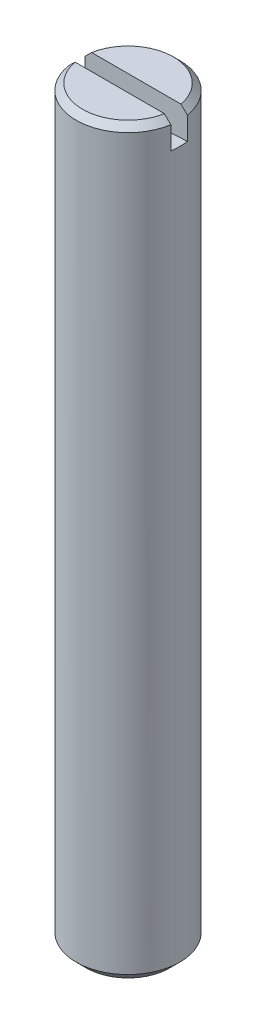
ISO-10303-21;
HEADER;
FILE_DESCRIPTION(('STEP AP214'),'2;1');
FILE_NAME('part.step','',(''),(''),'','','');
FILE_SCHEMA(('AUTOMOTIVE_DESIGN { 1 0 10303 214 1 1 1 1 }'));
ENDSEC;
DATA;
#1=APPLICATION_CONTEXT('core data for automotive mechanical design processes');
#2=APPLICATION_PROTOCOL_DEFINITION('international standard','automotive_design',2000,#1);
#3=PRODUCT_CONTEXT('',#1,'mechanical');
#4=PRODUCT('Part','Part','',(#3));
#5=PRODUCT_RELATED_PRODUCT_CATEGORY('part','',(#4));
#6=PRODUCT_DEFINITION_FORMATION('','',#4);
#7=PRODUCT_DEFINITION_CONTEXT('part definition',#1,'design');
#8=PRODUCT_DEFINITION('design','',#6,#7);
#9=PRODUCT_DEFINITION_SHAPE('','',#8);
#10=(LENGTH_UNIT() NAMED_UNIT(*) SI_UNIT(.MILLI.,.METRE.));
#11=(NAMED_UNIT(*) PLANE_ANGLE_UNIT() SI_UNIT($,.RADIAN.));
#12=(NAMED_UNIT(*) SI_UNIT($,.STERADIAN.) SOLID_ANGLE_UNIT());
#13=UNCERTAINTY_MEASURE_WITH_UNIT(LENGTH_MEASURE(1.E-05),#10,'distance_accuracy_value','');
#14=(GEOMETRIC_REPRESENTATION_CONTEXT(3) GLOBAL_UNCERTAINTY_ASSIGNED_CONTEXT((#13)) GLOBAL_UNIT_ASSIGNED_CONTEXT((#10,
#11,#12)) REPRESENTATION_CONTEXT('',''));
#15=CARTESIAN_POINT('',(0.,0.,0.));
#16=DIRECTION('',(0.,0.,1.));
#17=DIRECTION('',(1.,0.,0.));
#18=AXIS2_PLACEMENT_3D('',#15,#16,#17);
#19=CARTESIAN_POINT('',(0.,66.,0.4));
#20=DIRECTION('',(0.,0.,-1.));
#21=DIRECTION('',(-1.,0.,0.));
#22=AXIS2_PLACEMENT_3D('',#19,#20,#21);
#23=CYLINDRICAL_SURFACE('',#22,31.5);
#24=CARTESIAN_POINT('',(2.46779253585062,34.596815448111,-0.4));
#25=CARTESIAN_POINT('',(2.47854531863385,34.5976618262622,-0.333698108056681));
#26=CARTESIAN_POINT('',(2.48661458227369,34.598300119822,-0.266959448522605));
#27=CARTESIAN_POINT('',(2.49732458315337,34.5991493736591,-0.133478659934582));
#28=CARTESIAN_POINT('',(2.5,34.5993630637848,-0.066739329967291));
#29=CARTESIAN_POINT('',(2.5,34.5993630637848,0.066739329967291));
#30=CARTESIAN_POINT('',(2.49732458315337,34.5991493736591,0.133478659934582));
#31=CARTESIAN_POINT('',(2.48661458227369,34.598300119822,0.266959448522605));
#32=CARTESIAN_POINT('',(2.47854531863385,34.5976618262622,0.333698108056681));
#33=CARTESIAN_POINT('',(2.46779253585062,34.596815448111,0.4));
#34=B_SPLINE_CURVE_WITH_KNOTS('',3,(#24,#25,#26,#27,#28,#29,#30,#31,#32,#33),.UNSPECIFIED.,.F.,
.F.,(4,2,2,2,4),(0.,0.201464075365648,0.401628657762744,0.601793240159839,0.803257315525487),.UNSPECIFIED.);
#35=CARTESIAN_POINT('',(2.46779253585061,34.596815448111,-0.4));
#36=VERTEX_POINT('',#35);
#37=CARTESIAN_POINT('',(2.46779253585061,34.596815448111,0.4));
#38=VERTEX_POINT('',#37);
#39=EDGE_CURVE('E81',#36,#38,#34,.T.);
#40=ORIENTED_EDGE('',*,*,#39,.F.);
#41=CARTESIAN_POINT('',(0.,66.,-0.4));
#42=DIRECTION('',(0.,0.,-1.));
#43=DIRECTION('',(-1.,0.,0.));
#44=AXIS2_PLACEMENT_3D('',#41,#42,#43);
#45=CIRCLE('',#44,31.5);
#46=CARTESIAN_POINT('',(-2.46779253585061,34.596815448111,-0.4));
#47=VERTEX_POINT('',#46);
#48=EDGE_CURVE('E87',#47,#36,#45,.F.);
#49=ORIENTED_EDGE('',*,*,#48,.F.);
#50=CARTESIAN_POINT('',(-2.46779253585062,34.596815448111,0.4));
#51=CARTESIAN_POINT('',(-2.47854531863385,34.5976618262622,0.333698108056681));
#52=CARTESIAN_POINT('',(-2.48661458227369,34.598300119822,0.266959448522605));
#53=CARTESIAN_POINT('',(-2.49732458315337,34.5991493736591,0.133478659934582));
#54=CARTESIAN_POINT('',(-2.5,34.5993630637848,0.066739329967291));
#55=CARTESIAN_POINT('',(-2.5,34.5993630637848,-0.066739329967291));
#56=CARTESIAN_POINT('',(-2.49732458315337,34.5991493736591,-0.133478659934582));
#57=CARTESIAN_POINT('',(-2.48661458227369,34.598300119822,-0.266959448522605));
#58=CARTESIAN_POINT('',(-2.47854531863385,34.5976618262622,-0.333698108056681));
#59=CARTESIAN_POINT('',(-2.46779253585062,34.596815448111,-0.4));
#60=B_SPLINE_CURVE_WITH_KNOTS('',3,(#50,#51,#52,#53,#54,#55,#56,#57,#58,#59),.UNSPECIFIED.,.F.,
.F.,(4,2,2,2,4),(0.,0.201464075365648,0.401628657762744,0.601793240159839,0.803257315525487),.UNSPECIFIED.);
#61=CARTESIAN_POINT('',(-2.46779253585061,34.596815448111,0.4));
#62=VERTEX_POINT('',#61);
#63=EDGE_CURVE('E18',#62,#47,#60,.T.);
#64=ORIENTED_EDGE('',*,*,#63,.F.);
#65=CARTESIAN_POINT('',(0.,66.,0.4));
#66=DIRECTION('',(0.,0.,-1.));
#67=DIRECTION('',(-1.,0.,0.));
#68=AXIS2_PLACEMENT_3D('',#65,#66,#67);
#69=CIRCLE('',#68,31.5);
#70=EDGE_CURVE('E80',#62,#38,#69,.F.);
#71=ORIENTED_EDGE('',*,*,#70,.T.);
#72=EDGE_LOOP('',(#40,#49,#64,#71));
#73=FACE_BOUND('',#72,.T.);
#74=ADVANCED_FACE('F14',(#73),#23,.F.);
#75=CARTESIAN_POINT('',(0.,66.,0.4));
#76=DIRECTION('',(0.,0.,1.));
#77=DIRECTION('',(1.,0.,0.));
#78=AXIS2_PLACEMENT_3D('',#75,#76,#77);
#79=PLANE('',#78);
#80=DIRECTION('',(1.,0.,0.));
#81=VECTOR('',#80,1.);
#82=CARTESIAN_POINT('',(0.,36.,0.4));
#83=LINE('',#82,#81);
#84=CARTESIAN_POINT('',(-2.15672025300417,35.9999999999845,0.4));
#85=VERTEX_POINT('',#84);
#86=CARTESIAN_POINT('',(2.15672025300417,35.9999999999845,0.4));
#87=VERTEX_POINT('',#86);
#88=EDGE_CURVE('E156',#85,#87,#83,.T.);
#89=ORIENTED_EDGE('',*,*,#88,.T.);
#90=CARTESIAN_POINT('',(2.46779253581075,35.6934999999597,0.4));
#91=CARTESIAN_POINT('',(2.41599728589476,35.7446342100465,0.4));
#92=CARTESIAN_POINT('',(2.36417697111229,35.795742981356,0.4));
#93=CARTESIAN_POINT('',(2.26048621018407,35.8979096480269,0.4));
#94=CARTESIAN_POINT('',(2.20861576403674,35.9489675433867,0.4));
#95=CARTESIAN_POINT('',(2.15672025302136,35.9999999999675,0.4));
#96=B_SPLINE_CURVE_WITH_KNOTS('',3,(#90,#91,#92,#93,#94,#95),.UNSPECIFIED.,.F.,.F.,(4,2,4),(0.,
0.218350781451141,0.436701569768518),.UNSPECIFIED.);
#97=CARTESIAN_POINT('',(2.46779253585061,35.6934999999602,0.4));
#98=VERTEX_POINT('',#97);
#99=EDGE_CURVE('E94',#98,#87,#96,.T.);
#100=ORIENTED_EDGE('',*,*,#99,.F.);
#101=DIRECTION('',(0.,1.,0.));
#102=VECTOR('',#101,1.);
#103=CARTESIAN_POINT('',(2.46779253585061,66.,0.4));
#104=LINE('',#103,#102);
#105=EDGE_CURVE('E92',#38,#98,#104,.T.);
#106=ORIENTED_EDGE('',*,*,#105,.F.);
#107=ORIENTED_EDGE('',*,*,#70,.F.);
#108=DIRECTION('',(0.,1.,0.));
#109=VECTOR('',#108,1.);
#110=CARTESIAN_POINT('',(-2.46779253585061,66.,0.4));
#111=LINE('',#110,#109);
#112=CARTESIAN_POINT('',(-2.46779253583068,35.6934999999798,0.4));
#113=VERTEX_POINT('',#112);
#114=EDGE_CURVE('E72',#113,#62,#111,.F.);
#115=ORIENTED_EDGE('',*,*,#114,.F.);
#116=CARTESIAN_POINT('',(-2.15672025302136,35.9999999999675,0.4));
#117=CARTESIAN_POINT('',(-2.20861576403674,35.9489675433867,0.4));
#118=CARTESIAN_POINT('',(-2.26048621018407,35.8979096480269,0.4));
#119=CARTESIAN_POINT('',(-2.36417697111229,35.795742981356,0.4));
#120=CARTESIAN_POINT('',(-2.41599728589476,35.7446342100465,0.4));
#121=CARTESIAN_POINT('',(-2.46779253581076,35.6934999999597,0.4));
#122=B_SPLINE_CURVE_WITH_KNOTS('',3,(#116,#117,#118,#119,#120,#121),.UNSPECIFIED.,.F.,.F.,(4,2,
4),(0.,0.218350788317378,0.436701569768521),.UNSPECIFIED.);
#123=EDGE_CURVE('E144',#85,#113,#122,.T.);
#124=ORIENTED_EDGE('',*,*,#123,.F.);
#125=EDGE_LOOP('',(#89,#100,#106,#107,#115,#124));
#126=FACE_BOUND('',#125,.T.);
#127=ADVANCED_FACE('F90',(#126),#79,.F.);
#128=CARTESIAN_POINT('',(0.,66.,-0.4));
#129=DIRECTION('',(0.,0.,1.));
#130=DIRECTION('',(1.,0.,0.));
#131=AXIS2_PLACEMENT_3D('',#128,#129,#130);
#132=PLANE('',#131);
#133=DIRECTION('',(1.,0.,0.));
#134=VECTOR('',#133,1.);
#135=CARTESIAN_POINT('',(0.,36.,-0.4));
#136=LINE('',#135,#134);
#137=CARTESIAN_POINT('',(2.15672025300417,35.9999999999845,-0.4));
#138=VERTEX_POINT('',#137);
#139=CARTESIAN_POINT('',(-2.15672025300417,35.9999999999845,-0.4));
#140=VERTEX_POINT('',#139);
#141=EDGE_CURVE('E158',#138,#140,#136,.F.);
#142=ORIENTED_EDGE('',*,*,#141,.T.);
#143=CARTESIAN_POINT('',(-2.15672025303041,35.9999999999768,-0.400000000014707));
#144=CARTESIAN_POINT('',(-2.20861576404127,35.9489675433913,-0.400000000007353));
#145=CARTESIAN_POINT('',(-2.26048621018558,35.8979096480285,-0.400000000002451));
#146=CARTESIAN_POINT('',(-2.36417697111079,35.7957429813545,-0.399999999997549));
#147=CARTESIAN_POINT('',(-2.41599728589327,35.7446342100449,-0.399999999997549));
#148=CARTESIAN_POINT('',(-2.46779253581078,35.6934999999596,-0.4));
#149=B_SPLINE_CURVE_WITH_KNOTS('',3,(#143,#144,#145,#146,#147,#148),.UNSPECIFIED.,.F.,.F.,(4,2,
4),(0.,0.218350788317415,0.436701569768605),.UNSPECIFIED.);
#150=CARTESIAN_POINT('',(-2.46779253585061,35.6934999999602,-0.4));
#151=VERTEX_POINT('',#150);
#152=EDGE_CURVE('E38',#140,#151,#149,.T.);
#153=ORIENTED_EDGE('',*,*,#152,.T.);
#154=DIRECTION('',(0.,1.,0.));
#155=VECTOR('',#154,1.);
#156=CARTESIAN_POINT('',(-2.46779253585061,66.,-0.4));
#157=LINE('',#156,#155);
#158=EDGE_CURVE('E149',#151,#47,#157,.F.);
#159=ORIENTED_EDGE('',*,*,#158,.T.);
#160=ORIENTED_EDGE('',*,*,#48,.T.);
#161=DIRECTION('',(0.,1.,0.));
#162=VECTOR('',#161,1.);
#163=CARTESIAN_POINT('',(2.46779253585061,66.,-0.4));
#164=LINE('',#163,#162);
#165=CARTESIAN_POINT('',(2.46779253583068,35.6934999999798,-0.4));
#166=VERTEX_POINT('',#165);
#167=EDGE_CURVE('E132',#36,#166,#164,.T.);
#168=ORIENTED_EDGE('',*,*,#167,.T.);
#169=CARTESIAN_POINT('',(2.46779253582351,35.6934999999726,-0.400000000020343));
#170=CARTESIAN_POINT('',(2.41599728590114,35.7446342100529,-0.400000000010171));
#171=CARTESIAN_POINT('',(2.36417697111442,35.7957429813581,-0.400000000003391));
#172=CARTESIAN_POINT('',(2.26048621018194,35.8979096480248,-0.39999999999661));
#173=CARTESIAN_POINT('',(2.20861576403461,35.9489675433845,-0.39999999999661));
#174=CARTESIAN_POINT('',(2.15672025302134,35.9999999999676,-0.4));
#175=B_SPLINE_CURVE_WITH_KNOTS('',3,(#169,#170,#171,#172,#173,#174),.UNSPECIFIED.,.F.,.F.,(4,2,
4),(0.,0.218350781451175,0.436701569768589),.UNSPECIFIED.);
#176=EDGE_CURVE('E126',#166,#138,#175,.T.);
#177=ORIENTED_EDGE('',*,*,#176,.T.);
#178=EDGE_LOOP('',(#142,#153,#159,#160,#168,#177));
#179=FACE_BOUND('',#178,.T.);
#180=ADVANCED_FACE('F133',(#179),#132,.T.);
#181=CARTESIAN_POINT('',(2.0095,0.,0.));
#182=DIRECTION('',(0.,1.,0.));
#183=DIRECTION('',(0.,0.,1.));
#184=AXIS2_PLACEMENT_3D('',#181,#182,#183);
#185=PLANE('',#184);
#186=CARTESIAN_POINT('',(0.,-5.6843418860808E-11,0.));
#187=DIRECTION('',(0.,1.,0.));
#188=DIRECTION('',(0.,0.,1.));
#189=AXIS2_PLACEMENT_3D('',#186,#187,#188);
#190=CIRCLE('',#189,2.00949999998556);
#191=CARTESIAN_POINT('',(0.,-5.6843418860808E-11,2.00949999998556));
#192=VERTEX_POINT('',#191);
#193=EDGE_CURVE('E162',#192,#192,#190,.T.);
#194=ORIENTED_EDGE('',*,*,#193,.F.);
#195=EDGE_LOOP('',(#194));
#196=FACE_BOUND('',#195,.T.);
#197=ADVANCED_FACE('F137',(#196),#185,.F.);
#198=CARTESIAN_POINT('',(0.,36.,0.));
#199=DIRECTION('',(0.,-1.,0.));
#200=DIRECTION('',(0.,0.,-1.));
#201=AXIS2_PLACEMENT_3D('',#198,#199,#200);
#202=PLANE('',#201);
#203=ORIENTED_EDGE('',*,*,#88,.F.);
#204=CARTESIAN_POINT('',(0.,36.0000000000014,0.));
#205=DIRECTION('',(0.,-1.,0.));
#206=DIRECTION('',(0.,0.,-1.));
#207=AXIS2_PLACEMENT_3D('',#204,#205,#206);
#208=CIRCLE('',#207,2.19349999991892);
#209=EDGE_CURVE('E154',#87,#85,#208,.T.);
#210=ORIENTED_EDGE('',*,*,#209,.F.);
#211=EDGE_LOOP('',(#203,#210));
#212=FACE_BOUND('',#211,.T.);
#213=ADVANCED_FACE('F160',(#212),#202,.F.);
#214=CARTESIAN_POINT('',(0.,36.,0.));
#215=DIRECTION('',(0.,-1.,0.));
#216=DIRECTION('',(0.,0.,-1.));
#217=AXIS2_PLACEMENT_3D('',#214,#215,#216);
#218=PLANE('',#217);
#219=CARTESIAN_POINT('',(0.,36.0000000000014,0.));
#220=DIRECTION('',(0.,-1.,0.));
#221=DIRECTION('',(0.,0.,-1.));
#222=AXIS2_PLACEMENT_3D('',#219,#220,#221);
#223=CIRCLE('',#222,2.19349999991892);
#224=EDGE_CURVE('E161',#140,#138,#223,.T.);
#225=ORIENTED_EDGE('',*,*,#224,.F.);
#226=ORIENTED_EDGE('',*,*,#141,.F.);
#227=EDGE_LOOP('',(#225,#226));
#228=FACE_BOUND('',#227,.T.);
#229=ADVANCED_FACE('F182',(#228),#218,.F.);
#230=CARTESIAN_POINT('',(0.,0.490500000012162,0.));
#231=DIRECTION('',(0.,1.,0.));
#232=DIRECTION('',(0.,0.,1.));
#233=AXIS2_PLACEMENT_3D('',#230,#231,#232);
#234=CONICAL_SURFACE('',#233,2.50000000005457,0.785398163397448);
#235=CARTESIAN_POINT('',(0.,0.4905,0.));
#236=DIRECTION('',(0.,-1.,0.));
#237=DIRECTION('',(0.,0.,-1.));
#238=AXIS2_PLACEMENT_3D('',#235,#236,#237);
#239=CIRCLE('',#238,2.5);
#240=CARTESIAN_POINT('',(0.,0.4905,-2.5));
#241=VERTEX_POINT('',#240);
#242=EDGE_CURVE('E164',#241,#241,#239,.F.);
#243=ORIENTED_EDGE('',*,*,#242,.F.);
#244=EDGE_LOOP('',(#243));
#245=FACE_BOUND('',#244,.T.);
#246=ORIENTED_EDGE('',*,*,#193,.T.);
#247=EDGE_LOOP('',(#246));
#248=FACE_BOUND('',#247,.T.);
#249=ADVANCED_FACE('F179',(#245,#248),#234,.T.);
#250=CARTESIAN_POINT('',(0.,35.6934999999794,0.));
#251=DIRECTION('',(0.,-1.,0.));
#252=DIRECTION('',(0.,0.,-1.));
#253=AXIS2_PLACEMENT_3D('',#250,#251,#252);
#254=CONICAL_SURFACE('',#253,2.49999999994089,0.785398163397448);
#255=ORIENTED_EDGE('',*,*,#209,.T.);
#256=ORIENTED_EDGE('',*,*,#123,.T.);
#257=CARTESIAN_POINT('',(0.,35.6935,0.));
#258=DIRECTION('',(0.,-1.,0.));
#259=DIRECTION('',(0.,0.,-1.));
#260=AXIS2_PLACEMENT_3D('',#257,#258,#259);
#261=CIRCLE('',#260,2.5);
#262=EDGE_CURVE('E29',#98,#113,#261,.T.);
#263=ORIENTED_EDGE('',*,*,#262,.F.);
#264=ORIENTED_EDGE('',*,*,#99,.T.);
#265=EDGE_LOOP('',(#255,#256,#263,#264));
#266=FACE_BOUND('',#265,.T.);
#267=ADVANCED_FACE('F114',(#266),#254,.T.);
#268=CARTESIAN_POINT('',(0.,35.6934999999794,0.));
#269=DIRECTION('',(0.,-1.,0.));
#270=DIRECTION('',(0.,0.,-1.));
#271=AXIS2_PLACEMENT_3D('',#268,#269,#270);
#272=CONICAL_SURFACE('',#271,2.49999999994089,0.785398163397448);
#273=ORIENTED_EDGE('',*,*,#152,.F.);
#274=ORIENTED_EDGE('',*,*,#224,.T.);
#275=ORIENTED_EDGE('',*,*,#176,.F.);
#276=CARTESIAN_POINT('',(0.,35.6935,0.));
#277=DIRECTION('',(0.,-1.,0.));
#278=DIRECTION('',(0.,0.,-1.));
#279=AXIS2_PLACEMENT_3D('',#276,#277,#278);
#280=CIRCLE('',#279,2.5);
#281=EDGE_CURVE('E9',#151,#166,#280,.T.);
#282=ORIENTED_EDGE('',*,*,#281,.F.);
#283=EDGE_LOOP('',(#273,#274,#275,#282));
#284=FACE_BOUND('',#283,.T.);
#285=ADVANCED_FACE('F110',(#284),#272,.T.);
#286=CARTESIAN_POINT('',(0.,26.5,0.));
#287=DIRECTION('',(0.,-1.,0.));
#288=DIRECTION('',(0.,0.,-1.));
#289=AXIS2_PLACEMENT_3D('',#286,#287,#288);
#290=CYLINDRICAL_SURFACE('',#289,2.5);
#291=ORIENTED_EDGE('',*,*,#39,.T.);
#292=ORIENTED_EDGE('',*,*,#105,.T.);
#293=ORIENTED_EDGE('',*,*,#262,.T.);
#294=ORIENTED_EDGE('',*,*,#114,.T.);
#295=ORIENTED_EDGE('',*,*,#63,.T.);
#296=ORIENTED_EDGE('',*,*,#158,.F.);
#297=ORIENTED_EDGE('',*,*,#281,.T.);
#298=ORIENTED_EDGE('',*,*,#167,.F.);
#299=EDGE_LOOP('',(#291,#292,#293,#294,#295,#296,#297,#298));
#300=FACE_BOUND('',#299,.T.);
#301=ORIENTED_EDGE('',*,*,#242,.T.);
#302=EDGE_LOOP('',(#301));
#303=FACE_BOUND('',#302,.T.);
#304=ADVANCED_FACE('F74',(#300,#303),#290,.T.);
#305=CLOSED_SHELL('',(#74,#127,#180,#197,#213,#229,#249,#267,#285,#304));
#306=MANIFOLD_SOLID_BREP('B1',#305);
#307=ADVANCED_BREP_SHAPE_REPRESENTATION('',(#18,#306),#14);
#308=SHAPE_DEFINITION_REPRESENTATION(#9,#307);
ENDSEC;
END-ISO-10303-21;
